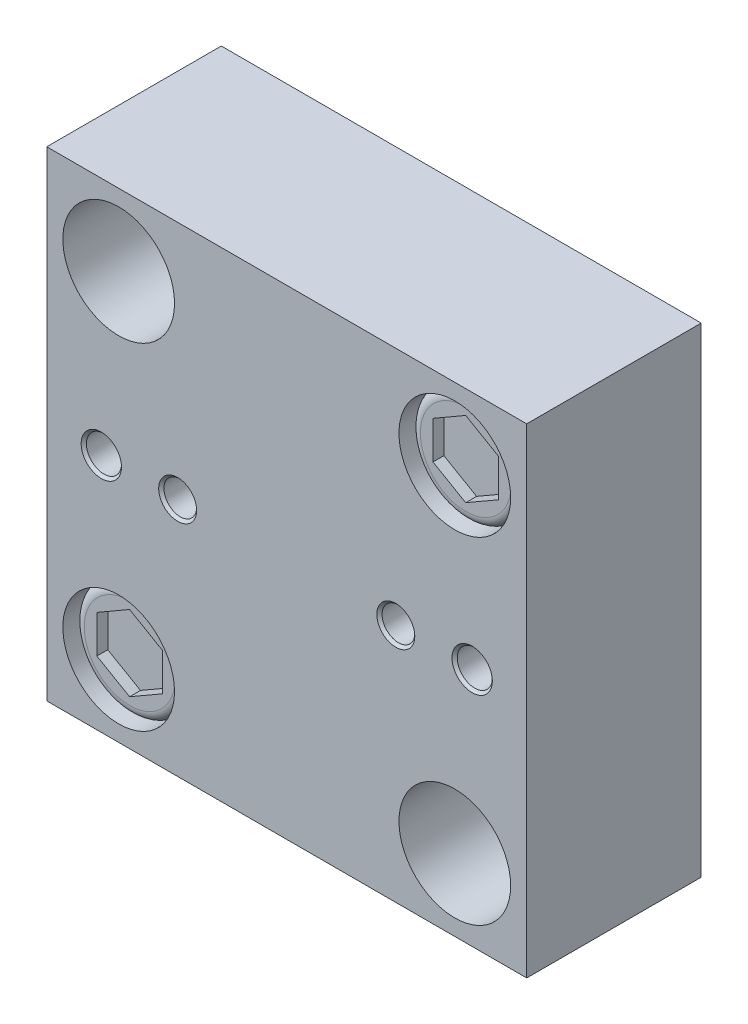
ISO-10303-21;
HEADER;
FILE_DESCRIPTION(('STEP AP214'),'2;1');
FILE_NAME('part.step','',(''),(''),'','','');
FILE_SCHEMA(('AUTOMOTIVE_DESIGN { 1 0 10303 214 1 1 1 1 }'));
ENDSEC;
DATA;
#1=APPLICATION_CONTEXT('core data for automotive mechanical design processes');
#2=APPLICATION_PROTOCOL_DEFINITION('international standard','automotive_design',2000,#1);
#3=PRODUCT_CONTEXT('',#1,'mechanical');
#4=PRODUCT('Part','Part','',(#3));
#5=PRODUCT_RELATED_PRODUCT_CATEGORY('part','',(#4));
#6=PRODUCT_DEFINITION_FORMATION('','',#4);
#7=PRODUCT_DEFINITION_CONTEXT('part definition',#1,'design');
#8=PRODUCT_DEFINITION('design','',#6,#7);
#9=PRODUCT_DEFINITION_SHAPE('','',#8);
#10=(LENGTH_UNIT() NAMED_UNIT(*) SI_UNIT(.MILLI.,.METRE.));
#11=(NAMED_UNIT(*) PLANE_ANGLE_UNIT() SI_UNIT($,.RADIAN.));
#12=(NAMED_UNIT(*) SI_UNIT($,.STERADIAN.) SOLID_ANGLE_UNIT());
#13=UNCERTAINTY_MEASURE_WITH_UNIT(LENGTH_MEASURE(1.E-05),#10,'distance_accuracy_value','');
#14=(GEOMETRIC_REPRESENTATION_CONTEXT(3) GLOBAL_UNCERTAINTY_ASSIGNED_CONTEXT((#13)) GLOBAL_UNIT_ASSIGNED_CONTEXT((#10,
#11,#12)) REPRESENTATION_CONTEXT('',''));
#15=CARTESIAN_POINT('',(0.,0.,0.));
#16=DIRECTION('',(0.,0.,1.));
#17=DIRECTION('',(1.,0.,0.));
#18=AXIS2_PLACEMENT_3D('',#15,#16,#17);
#19=CARTESIAN_POINT('',(-34.925,-34.925,23.8125));
#20=DIRECTION('',(0.,0.,1.));
#21=DIRECTION('',(1.,0.,0.));
#22=AXIS2_PLACEMENT_3D('',#19,#20,#21);
#23=PLANE('',#22);
#24=DIRECTION('',(-0.866025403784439,0.5,0.));
#25=VECTOR('',#24,1.);
#26=CARTESIAN_POINT('',(-19.6977,-21.7105693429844,23.8125));
#27=LINE('',#26,#25);
#28=CARTESIAN_POINT('',(-19.6977,-21.7105693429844,23.8125));
#29=VERTEX_POINT('',#28);
#30=CARTESIAN_POINT('',(-24.4602,-18.9609386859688,23.8125));
#31=VERTEX_POINT('',#30);
#32=EDGE_CURVE('E61',#29,#31,#27,.T.);
#33=ORIENTED_EDGE('',*,*,#32,.F.);
#34=DIRECTION('',(0.,1.,0.));
#35=VECTOR('',#34,1.);
#36=CARTESIAN_POINT('',(-19.6977,-27.2098306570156,23.8125));
#37=LINE('',#36,#35);
#38=CARTESIAN_POINT('',(-19.6977,-27.2098306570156,23.8125));
#39=VERTEX_POINT('',#38);
#40=EDGE_CURVE('E144',#39,#29,#37,.T.);
#41=ORIENTED_EDGE('',*,*,#40,.F.);
#42=DIRECTION('',(0.866025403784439,0.5,0.));
#43=VECTOR('',#42,1.);
#44=CARTESIAN_POINT('',(-24.4602,-29.9594613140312,23.8125));
#45=LINE('',#44,#43);
#46=CARTESIAN_POINT('',(-24.4602,-29.9594613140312,23.8125));
#47=VERTEX_POINT('',#46);
#48=EDGE_CURVE('E142',#47,#39,#45,.T.);
#49=ORIENTED_EDGE('',*,*,#48,.F.);
#50=DIRECTION('',(0.866025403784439,-0.499999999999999,0.));
#51=VECTOR('',#50,1.);
#52=CARTESIAN_POINT('',(-29.2227,-27.2098306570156,23.8125));
#53=LINE('',#52,#51);
#54=CARTESIAN_POINT('',(-29.2227,-27.2098306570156,23.8125));
#55=VERTEX_POINT('',#54);
#56=EDGE_CURVE('E109',#55,#47,#53,.T.);
#57=ORIENTED_EDGE('',*,*,#56,.F.);
#58=DIRECTION('',(0.,-1.,0.));
#59=VECTOR('',#58,1.);
#60=CARTESIAN_POINT('',(-29.2227,-21.7105693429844,23.8125));
#61=LINE('',#60,#59);
#62=CARTESIAN_POINT('',(-29.2227,-21.7105693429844,23.8125));
#63=VERTEX_POINT('',#62);
#64=EDGE_CURVE('E138',#63,#55,#61,.T.);
#65=ORIENTED_EDGE('',*,*,#64,.F.);
#66=DIRECTION('',(-0.866025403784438,-0.5,0.));
#67=VECTOR('',#66,1.);
#68=CARTESIAN_POINT('',(-24.4602,-18.9609386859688,23.8125));
#69=LINE('',#68,#67);
#70=EDGE_CURVE('E135',#31,#63,#69,.T.);
#71=ORIENTED_EDGE('',*,*,#70,.F.);
#72=EDGE_LOOP('',(#33,#41,#49,#57,#65,#71));
#73=FACE_BOUND('',#72,.T.);
#74=CARTESIAN_POINT('',(-24.4602,-24.4602,23.8125));
#75=DIRECTION('',(0.,0.,1.));
#76=DIRECTION('',(1.,0.,0.));
#77=AXIS2_PLACEMENT_3D('',#74,#75,#76);
#78=CIRCLE('',#77,6.60399999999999);
#79=CARTESIAN_POINT('',(-17.8562,-24.4602,23.8125));
#80=VERTEX_POINT('',#79);
#81=EDGE_CURVE('E12',#80,#80,#78,.T.);
#82=ORIENTED_EDGE('',*,*,#81,.T.);
#83=EDGE_LOOP('',(#82));
#84=FACE_BOUND('',#83,.T.);
#85=ADVANCED_FACE('F46',(#73,#84),#23,.T.);
#86=CARTESIAN_POINT('',(-24.4602,-24.4602,0.));
#87=DIRECTION('',(0.,0.,-1.));
#88=DIRECTION('',(-1.,0.,0.));
#89=AXIS2_PLACEMENT_3D('',#86,#87,#88);
#90=PLANE('',#89);
#91=CARTESIAN_POINT('',(-24.4602,-24.4602,0.));
#92=DIRECTION('',(0.,0.,-1.));
#93=DIRECTION('',(-1.,0.,0.));
#94=AXIS2_PLACEMENT_3D('',#91,#92,#93);
#95=CIRCLE('',#94,8.12799999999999);
#96=CARTESIAN_POINT('',(-32.5882,-24.4602,0.));
#97=VERTEX_POINT('',#96);
#98=EDGE_CURVE('E148',#97,#97,#95,.T.);
#99=ORIENTED_EDGE('',*,*,#98,.T.);
#100=EDGE_LOOP('',(#99));
#101=FACE_BOUND('',#100,.T.);
#102=ADVANCED_FACE('F170',(#101),#90,.T.);
#103=CARTESIAN_POINT('',(-24.4602,-24.4602,48.389455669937));
#104=DIRECTION('',(0.,0.,-1.));
#105=DIRECTION('',(-1.,0.,0.));
#106=AXIS2_PLACEMENT_3D('',#103,#104,#105);
#107=CYLINDRICAL_SURFACE('',#106,8.12799999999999);
#108=CARTESIAN_POINT('',(-24.4602,-24.4602,22.2885));
#109=DIRECTION('',(0.,0.,1.));
#110=DIRECTION('',(1.,0.,0.));
#111=AXIS2_PLACEMENT_3D('',#108,#109,#110);
#112=CIRCLE('',#111,8.12799999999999);
#113=CARTESIAN_POINT('',(-16.3322,-24.4602,22.2885));
#114=VERTEX_POINT('',#113);
#115=EDGE_CURVE('E54',#114,#114,#112,.F.);
#116=ORIENTED_EDGE('',*,*,#115,.T.);
#117=EDGE_LOOP('',(#116));
#118=FACE_BOUND('',#117,.T.);
#119=ORIENTED_EDGE('',*,*,#98,.F.);
#120=EDGE_LOOP('',(#119));
#121=FACE_BOUND('',#120,.T.);
#122=ADVANCED_FACE('F158',(#118,#121),#107,.T.);
#123=CARTESIAN_POINT('',(-24.4602,-24.4602,22.2885));
#124=DIRECTION('',(0.,0.,1.));
#125=DIRECTION('',(1.,0.,0.));
#126=AXIS2_PLACEMENT_3D('',#123,#124,#125);
#127=TOROIDAL_SURFACE('',#126,6.60399999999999,1.524);
#128=ORIENTED_EDGE('',*,*,#81,.F.);
#129=EDGE_LOOP('',(#128));
#130=FACE_BOUND('',#129,.T.);
#131=ORIENTED_EDGE('',*,*,#115,.F.);
#132=EDGE_LOOP('',(#131));
#133=FACE_BOUND('',#132,.T.);
#134=ADVANCED_FACE('F48',(#130,#133),#127,.T.);
#135=CARTESIAN_POINT('',(-19.6977,-21.7105693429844,22.225));
#136=DIRECTION('',(0.5,0.866025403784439,0.));
#137=DIRECTION('',(-0.866025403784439,0.5,0.));
#138=AXIS2_PLACEMENT_3D('',#135,#136,#137);
#139=PLANE('',#138);
#140=ORIENTED_EDGE('',*,*,#32,.T.);
#141=DIRECTION('',(0.,0.,1.));
#142=VECTOR('',#141,1.);
#143=CARTESIAN_POINT('',(-24.4602,-18.9609386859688,22.225));
#144=LINE('',#143,#142);
#145=CARTESIAN_POINT('',(-24.4602,-18.9609386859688,22.225));
#146=VERTEX_POINT('',#145);
#147=EDGE_CURVE('E91',#146,#31,#144,.T.);
#148=ORIENTED_EDGE('',*,*,#147,.F.);
#149=DIRECTION('',(-0.866025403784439,0.5,0.));
#150=VECTOR('',#149,1.);
#151=CARTESIAN_POINT('',(-19.6977,-21.7105693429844,22.225));
#152=LINE('',#151,#150);
#153=CARTESIAN_POINT('',(-19.6977,-21.7105693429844,22.225));
#154=VERTEX_POINT('',#153);
#155=EDGE_CURVE('E146',#154,#146,#152,.T.);
#156=ORIENTED_EDGE('',*,*,#155,.F.);
#157=DIRECTION('',(0.,0.,1.));
#158=VECTOR('',#157,1.);
#159=CARTESIAN_POINT('',(-19.6977,-21.7105693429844,22.225));
#160=LINE('',#159,#158);
#161=EDGE_CURVE('E69',#154,#29,#160,.T.);
#162=ORIENTED_EDGE('',*,*,#161,.T.);
#163=EDGE_LOOP('',(#140,#148,#156,#162));
#164=FACE_BOUND('',#163,.T.);
#165=ADVANCED_FACE('F162',(#164),#139,.F.);
#166=CARTESIAN_POINT('',(-19.6977,-27.2098306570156,22.225));
#167=DIRECTION('',(1.,0.,0.));
#168=DIRECTION('',(0.,0.,-1.));
#169=AXIS2_PLACEMENT_3D('',#166,#167,#168);
#170=PLANE('',#169);
#171=ORIENTED_EDGE('',*,*,#40,.T.);
#172=ORIENTED_EDGE('',*,*,#161,.F.);
#173=DIRECTION('',(0.,1.,0.));
#174=VECTOR('',#173,1.);
#175=CARTESIAN_POINT('',(-19.6977,-27.2098306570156,22.225));
#176=LINE('',#175,#174);
#177=CARTESIAN_POINT('',(-19.6977,-27.2098306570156,22.225));
#178=VERTEX_POINT('',#177);
#179=EDGE_CURVE('E121',#178,#154,#176,.T.);
#180=ORIENTED_EDGE('',*,*,#179,.F.);
#181=DIRECTION('',(0.,0.,1.));
#182=VECTOR('',#181,1.);
#183=CARTESIAN_POINT('',(-19.6977,-27.2098306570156,22.225));
#184=LINE('',#183,#182);
#185=EDGE_CURVE('E113',#178,#39,#184,.T.);
#186=ORIENTED_EDGE('',*,*,#185,.T.);
#187=EDGE_LOOP('',(#171,#172,#180,#186));
#188=FACE_BOUND('',#187,.T.);
#189=ADVANCED_FACE('F168',(#188),#170,.F.);
#190=CARTESIAN_POINT('',(-24.4602,-29.9594613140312,22.225));
#191=DIRECTION('',(0.5,-0.866025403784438,0.));
#192=DIRECTION('',(0.866025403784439,0.5,0.));
#193=AXIS2_PLACEMENT_3D('',#190,#191,#192);
#194=PLANE('',#193);
#195=ORIENTED_EDGE('',*,*,#48,.T.);
#196=ORIENTED_EDGE('',*,*,#185,.F.);
#197=DIRECTION('',(0.866025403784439,0.5,0.));
#198=VECTOR('',#197,1.);
#199=CARTESIAN_POINT('',(-24.4602,-29.9594613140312,22.225));
#200=LINE('',#199,#198);
#201=CARTESIAN_POINT('',(-24.4602,-29.9594613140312,22.225));
#202=VERTEX_POINT('',#201);
#203=EDGE_CURVE('E117',#202,#178,#200,.T.);
#204=ORIENTED_EDGE('',*,*,#203,.F.);
#205=DIRECTION('',(0.,0.,1.));
#206=VECTOR('',#205,1.);
#207=CARTESIAN_POINT('',(-24.4602,-29.9594613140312,22.225));
#208=LINE('',#207,#206);
#209=EDGE_CURVE('E102',#202,#47,#208,.T.);
#210=ORIENTED_EDGE('',*,*,#209,.T.);
#211=EDGE_LOOP('',(#195,#196,#204,#210));
#212=FACE_BOUND('',#211,.T.);
#213=ADVANCED_FACE('F118',(#212),#194,.F.);
#214=CARTESIAN_POINT('',(-29.2227,-27.2098306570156,22.225));
#215=DIRECTION('',(-0.499999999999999,-0.866025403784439,0.));
#216=DIRECTION('',(0.866025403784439,-0.5,0.));
#217=AXIS2_PLACEMENT_3D('',#214,#215,#216);
#218=PLANE('',#217);
#219=ORIENTED_EDGE('',*,*,#56,.T.);
#220=ORIENTED_EDGE('',*,*,#209,.F.);
#221=DIRECTION('',(0.866025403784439,-0.499999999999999,0.));
#222=VECTOR('',#221,1.);
#223=CARTESIAN_POINT('',(-29.2227,-27.2098306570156,22.225));
#224=LINE('',#223,#222);
#225=CARTESIAN_POINT('',(-29.2227,-27.2098306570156,22.225));
#226=VERTEX_POINT('',#225);
#227=EDGE_CURVE('E106',#226,#202,#224,.T.);
#228=ORIENTED_EDGE('',*,*,#227,.F.);
#229=DIRECTION('',(0.,0.,1.));
#230=VECTOR('',#229,1.);
#231=CARTESIAN_POINT('',(-29.2227,-27.2098306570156,22.225));
#232=LINE('',#231,#230);
#233=EDGE_CURVE('E114',#226,#55,#232,.T.);
#234=ORIENTED_EDGE('',*,*,#233,.T.);
#235=EDGE_LOOP('',(#219,#220,#228,#234));
#236=FACE_BOUND('',#235,.T.);
#237=ADVANCED_FACE('F104',(#236),#218,.F.);
#238=CARTESIAN_POINT('',(-29.2227,-21.7105693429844,22.225));
#239=DIRECTION('',(-1.,0.,0.));
#240=DIRECTION('',(0.,0.,1.));
#241=AXIS2_PLACEMENT_3D('',#238,#239,#240);
#242=PLANE('',#241);
#243=ORIENTED_EDGE('',*,*,#64,.T.);
#244=ORIENTED_EDGE('',*,*,#233,.F.);
#245=DIRECTION('',(0.,-1.,0.));
#246=VECTOR('',#245,1.);
#247=CARTESIAN_POINT('',(-29.2227,-21.7105693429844,22.225));
#248=LINE('',#247,#246);
#249=CARTESIAN_POINT('',(-29.2227,-21.7105693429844,22.225));
#250=VERTEX_POINT('',#249);
#251=EDGE_CURVE('E127',#250,#226,#248,.T.);
#252=ORIENTED_EDGE('',*,*,#251,.F.);
#253=DIRECTION('',(0.,0.,1.));
#254=VECTOR('',#253,1.);
#255=CARTESIAN_POINT('',(-29.2227,-21.7105693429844,22.225));
#256=LINE('',#255,#254);
#257=EDGE_CURVE('E151',#250,#63,#256,.T.);
#258=ORIENTED_EDGE('',*,*,#257,.T.);
#259=EDGE_LOOP('',(#243,#244,#252,#258));
#260=FACE_BOUND('',#259,.T.);
#261=ADVANCED_FACE('F185',(#260),#242,.F.);
#262=CARTESIAN_POINT('',(-24.4602,-18.9609386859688,22.225));
#263=DIRECTION('',(-0.5,0.866025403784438,0.));
#264=DIRECTION('',(-0.866025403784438,-0.5,0.));
#265=AXIS2_PLACEMENT_3D('',#262,#263,#264);
#266=PLANE('',#265);
#267=ORIENTED_EDGE('',*,*,#70,.T.);
#268=ORIENTED_EDGE('',*,*,#257,.F.);
#269=DIRECTION('',(-0.866025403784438,-0.5,0.));
#270=VECTOR('',#269,1.);
#271=CARTESIAN_POINT('',(-24.4602,-18.9609386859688,22.225));
#272=LINE('',#271,#270);
#273=EDGE_CURVE('E129',#146,#250,#272,.T.);
#274=ORIENTED_EDGE('',*,*,#273,.F.);
#275=ORIENTED_EDGE('',*,*,#147,.T.);
#276=EDGE_LOOP('',(#267,#268,#274,#275));
#277=FACE_BOUND('',#276,.T.);
#278=ADVANCED_FACE('F182',(#277),#266,.F.);
#279=CARTESIAN_POINT('',(0.,0.,22.225));
#280=DIRECTION('',(0.,0.,1.));
#281=DIRECTION('',(1.,0.,0.));
#282=AXIS2_PLACEMENT_3D('',#279,#280,#281);
#283=PLANE('',#282);
#284=ORIENTED_EDGE('',*,*,#155,.T.);
#285=ORIENTED_EDGE('',*,*,#273,.T.);
#286=ORIENTED_EDGE('',*,*,#251,.T.);
#287=ORIENTED_EDGE('',*,*,#227,.T.);
#288=ORIENTED_EDGE('',*,*,#203,.T.);
#289=ORIENTED_EDGE('',*,*,#179,.T.);
#290=EDGE_LOOP('',(#284,#285,#286,#287,#288,#289));
#291=FACE_BOUND('',#290,.T.);
#292=ADVANCED_FACE('F124',(#291),#283,.T.);
#293=CLOSED_SHELL('',(#85,#102,#122,#134,#165,#189,#213,#237,#261,#278,#292));
#294=MANIFOLD_SOLID_BREP('B2',#293);
#295=CARTESIAN_POINT('',(-34.925,-34.925,23.8125));
#296=DIRECTION('',(0.,0.,1.));
#297=DIRECTION('',(1.,0.,0.));
#298=AXIS2_PLACEMENT_3D('',#295,#296,#297);
#299=PLANE('',#298);
#300=DIRECTION('',(-0.866025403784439,0.5,0.));
#301=VECTOR('',#300,1.);
#302=CARTESIAN_POINT('',(29.2227,27.2098306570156,23.8125));
#303=LINE('',#302,#301);
#304=CARTESIAN_POINT('',(29.2227,27.2098306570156,23.8125));
#305=VERTEX_POINT('',#304);
#306=CARTESIAN_POINT('',(24.4602,29.9594613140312,23.8125));
#307=VERTEX_POINT('',#306);
#308=EDGE_CURVE('E292',#305,#307,#303,.T.);
#309=ORIENTED_EDGE('',*,*,#308,.F.);
#310=DIRECTION('',(0.,1.,0.));
#311=VECTOR('',#310,1.);
#312=CARTESIAN_POINT('',(29.2227,21.7105693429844,23.8125));
#313=LINE('',#312,#311);
#314=CARTESIAN_POINT('',(29.2227,21.7105693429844,23.8125));
#315=VERTEX_POINT('',#314);
#316=EDGE_CURVE('E375',#315,#305,#313,.T.);
#317=ORIENTED_EDGE('',*,*,#316,.F.);
#318=DIRECTION('',(0.866025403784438,0.5,0.));
#319=VECTOR('',#318,1.);
#320=CARTESIAN_POINT('',(24.4602,18.9609386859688,23.8125));
#321=LINE('',#320,#319);
#322=CARTESIAN_POINT('',(24.4602,18.9609386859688,23.8125));
#323=VERTEX_POINT('',#322);
#324=EDGE_CURVE('E373',#323,#315,#321,.T.);
#325=ORIENTED_EDGE('',*,*,#324,.F.);
#326=DIRECTION('',(0.866025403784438,-0.5,0.));
#327=VECTOR('',#326,1.);
#328=CARTESIAN_POINT('',(19.6977,21.7105693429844,23.8125));
#329=LINE('',#328,#327);
#330=CARTESIAN_POINT('',(19.6977,21.7105693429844,23.8125));
#331=VERTEX_POINT('',#330);
#332=EDGE_CURVE('E340',#331,#323,#329,.T.);
#333=ORIENTED_EDGE('',*,*,#332,.F.);
#334=DIRECTION('',(0.,-1.,0.));
#335=VECTOR('',#334,1.);
#336=CARTESIAN_POINT('',(19.6977,27.2098306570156,23.8125));
#337=LINE('',#336,#335);
#338=CARTESIAN_POINT('',(19.6977,27.2098306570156,23.8125));
#339=VERTEX_POINT('',#338);
#340=EDGE_CURVE('E369',#339,#331,#337,.T.);
#341=ORIENTED_EDGE('',*,*,#340,.F.);
#342=DIRECTION('',(-0.866025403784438,-0.5,0.));
#343=VECTOR('',#342,1.);
#344=CARTESIAN_POINT('',(24.4602,29.9594613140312,23.8125));
#345=LINE('',#344,#343);
#346=EDGE_CURVE('E366',#307,#339,#345,.T.);
#347=ORIENTED_EDGE('',*,*,#346,.F.);
#348=EDGE_LOOP('',(#309,#317,#325,#333,#341,#347));
#349=FACE_BOUND('',#348,.T.);
#350=CARTESIAN_POINT('',(24.4602,24.4602,23.8125));
#351=DIRECTION('',(0.,0.,1.));
#352=DIRECTION('',(1.,0.,0.));
#353=AXIS2_PLACEMENT_3D('',#350,#351,#352);
#354=CIRCLE('',#353,6.60399999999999);
#355=CARTESIAN_POINT('',(31.0642,24.4602,23.8125));
#356=VERTEX_POINT('',#355);
#357=EDGE_CURVE('E44',#356,#356,#354,.T.);
#358=ORIENTED_EDGE('',*,*,#357,.T.);
#359=EDGE_LOOP('',(#358));
#360=FACE_BOUND('',#359,.T.);
#361=ADVANCED_FACE('F277',(#349,#360),#299,.T.);
#362=CARTESIAN_POINT('',(24.4602,24.4602,0.));
#363=DIRECTION('',(0.,0.,-1.));
#364=DIRECTION('',(-1.,0.,0.));
#365=AXIS2_PLACEMENT_3D('',#362,#363,#364);
#366=PLANE('',#365);
#367=CARTESIAN_POINT('',(24.4602,24.4602,0.));
#368=DIRECTION('',(0.,0.,-1.));
#369=DIRECTION('',(-1.,0.,0.));
#370=AXIS2_PLACEMENT_3D('',#367,#368,#369);
#371=CIRCLE('',#370,8.12799999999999);
#372=CARTESIAN_POINT('',(16.3322,24.4602,0.));
#373=VERTEX_POINT('',#372);
#374=EDGE_CURVE('E379',#373,#373,#371,.T.);
#375=ORIENTED_EDGE('',*,*,#374,.T.);
#376=EDGE_LOOP('',(#375));
#377=FACE_BOUND('',#376,.T.);
#378=ADVANCED_FACE('F401',(#377),#366,.T.);
#379=CARTESIAN_POINT('',(24.4602,24.4602,48.389455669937));
#380=DIRECTION('',(0.,0.,-1.));
#381=DIRECTION('',(-1.,0.,0.));
#382=AXIS2_PLACEMENT_3D('',#379,#380,#381);
#383=CYLINDRICAL_SURFACE('',#382,8.12799999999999);
#384=CARTESIAN_POINT('',(24.4602,24.4602,22.2885));
#385=DIRECTION('',(0.,0.,1.));
#386=DIRECTION('',(1.,0.,0.));
#387=AXIS2_PLACEMENT_3D('',#384,#385,#386);
#388=CIRCLE('',#387,8.12799999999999);
#389=CARTESIAN_POINT('',(32.5882,24.4602,22.2885));
#390=VERTEX_POINT('',#389);
#391=EDGE_CURVE('E285',#390,#390,#388,.F.);
#392=ORIENTED_EDGE('',*,*,#391,.T.);
#393=EDGE_LOOP('',(#392));
#394=FACE_BOUND('',#393,.T.);
#395=ORIENTED_EDGE('',*,*,#374,.F.);
#396=EDGE_LOOP('',(#395));
#397=FACE_BOUND('',#396,.T.);
#398=ADVANCED_FACE('F389',(#394,#397),#383,.T.);
#399=CARTESIAN_POINT('',(24.4602,24.4602,22.2885));
#400=DIRECTION('',(0.,0.,1.));
#401=DIRECTION('',(1.,0.,0.));
#402=AXIS2_PLACEMENT_3D('',#399,#400,#401);
#403=TOROIDAL_SURFACE('',#402,6.60399999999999,1.524);
#404=ORIENTED_EDGE('',*,*,#357,.F.);
#405=EDGE_LOOP('',(#404));
#406=FACE_BOUND('',#405,.T.);
#407=ORIENTED_EDGE('',*,*,#391,.F.);
#408=EDGE_LOOP('',(#407));
#409=FACE_BOUND('',#408,.T.);
#410=ADVANCED_FACE('F279',(#406,#409),#403,.T.);
#411=CARTESIAN_POINT('',(29.2227,27.2098306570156,22.225));
#412=DIRECTION('',(0.5,0.866025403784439,0.));
#413=DIRECTION('',(-0.866025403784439,0.5,0.));
#414=AXIS2_PLACEMENT_3D('',#411,#412,#413);
#415=PLANE('',#414);
#416=ORIENTED_EDGE('',*,*,#308,.T.);
#417=DIRECTION('',(0.,0.,1.));
#418=VECTOR('',#417,1.);
#419=CARTESIAN_POINT('',(24.4602,29.9594613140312,22.225));
#420=LINE('',#419,#418);
#421=CARTESIAN_POINT('',(24.4602,29.9594613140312,22.225));
#422=VERTEX_POINT('',#421);
#423=EDGE_CURVE('E322',#422,#307,#420,.T.);
#424=ORIENTED_EDGE('',*,*,#423,.F.);
#425=DIRECTION('',(-0.866025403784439,0.5,0.));
#426=VECTOR('',#425,1.);
#427=CARTESIAN_POINT('',(29.2227,27.2098306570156,22.225));
#428=LINE('',#427,#426);
#429=CARTESIAN_POINT('',(29.2227,27.2098306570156,22.225));
#430=VERTEX_POINT('',#429);
#431=EDGE_CURVE('E377',#430,#422,#428,.T.);
#432=ORIENTED_EDGE('',*,*,#431,.F.);
#433=DIRECTION('',(0.,0.,1.));
#434=VECTOR('',#433,1.);
#435=CARTESIAN_POINT('',(29.2227,27.2098306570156,22.225));
#436=LINE('',#435,#434);
#437=EDGE_CURVE('E300',#430,#305,#436,.T.);
#438=ORIENTED_EDGE('',*,*,#437,.T.);
#439=EDGE_LOOP('',(#416,#424,#432,#438));
#440=FACE_BOUND('',#439,.T.);
#441=ADVANCED_FACE('F393',(#440),#415,.F.);
#442=CARTESIAN_POINT('',(29.2227,21.7105693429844,22.225));
#443=DIRECTION('',(1.,0.,0.));
#444=DIRECTION('',(0.,0.,-1.));
#445=AXIS2_PLACEMENT_3D('',#442,#443,#444);
#446=PLANE('',#445);
#447=ORIENTED_EDGE('',*,*,#316,.T.);
#448=ORIENTED_EDGE('',*,*,#437,.F.);
#449=DIRECTION('',(0.,1.,0.));
#450=VECTOR('',#449,1.);
#451=CARTESIAN_POINT('',(29.2227,21.7105693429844,22.225));
#452=LINE('',#451,#450);
#453=CARTESIAN_POINT('',(29.2227,21.7105693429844,22.225));
#454=VERTEX_POINT('',#453);
#455=EDGE_CURVE('E352',#454,#430,#452,.T.);
#456=ORIENTED_EDGE('',*,*,#455,.F.);
#457=DIRECTION('',(0.,0.,1.));
#458=VECTOR('',#457,1.);
#459=CARTESIAN_POINT('',(29.2227,21.7105693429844,22.225));
#460=LINE('',#459,#458);
#461=EDGE_CURVE('E344',#454,#315,#460,.T.);
#462=ORIENTED_EDGE('',*,*,#461,.T.);
#463=EDGE_LOOP('',(#447,#448,#456,#462));
#464=FACE_BOUND('',#463,.T.);
#465=ADVANCED_FACE('F399',(#464),#446,.F.);
#466=CARTESIAN_POINT('',(24.4602,18.9609386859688,22.225));
#467=DIRECTION('',(0.5,-0.866025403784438,0.));
#468=DIRECTION('',(0.866025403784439,0.5,0.));
#469=AXIS2_PLACEMENT_3D('',#466,#467,#468);
#470=PLANE('',#469);
#471=ORIENTED_EDGE('',*,*,#324,.T.);
#472=ORIENTED_EDGE('',*,*,#461,.F.);
#473=DIRECTION('',(0.866025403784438,0.5,0.));
#474=VECTOR('',#473,1.);
#475=CARTESIAN_POINT('',(24.4602,18.9609386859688,22.225));
#476=LINE('',#475,#474);
#477=CARTESIAN_POINT('',(24.4602,18.9609386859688,22.225));
#478=VERTEX_POINT('',#477);
#479=EDGE_CURVE('E348',#478,#454,#476,.T.);
#480=ORIENTED_EDGE('',*,*,#479,.F.);
#481=DIRECTION('',(0.,0.,1.));
#482=VECTOR('',#481,1.);
#483=CARTESIAN_POINT('',(24.4602,18.9609386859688,22.225));
#484=LINE('',#483,#482);
#485=EDGE_CURVE('E333',#478,#323,#484,.T.);
#486=ORIENTED_EDGE('',*,*,#485,.T.);
#487=EDGE_LOOP('',(#471,#472,#480,#486));
#488=FACE_BOUND('',#487,.T.);
#489=ADVANCED_FACE('F349',(#488),#470,.F.);
#490=CARTESIAN_POINT('',(19.6977,21.7105693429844,22.225));
#491=DIRECTION('',(-0.5,-0.866025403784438,0.));
#492=DIRECTION('',(0.866025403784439,-0.5,0.));
#493=AXIS2_PLACEMENT_3D('',#490,#491,#492);
#494=PLANE('',#493);
#495=ORIENTED_EDGE('',*,*,#332,.T.);
#496=ORIENTED_EDGE('',*,*,#485,.F.);
#497=DIRECTION('',(0.866025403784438,-0.5,0.));
#498=VECTOR('',#497,1.);
#499=CARTESIAN_POINT('',(19.6977,21.7105693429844,22.225));
#500=LINE('',#499,#498);
#501=CARTESIAN_POINT('',(19.6977,21.7105693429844,22.225));
#502=VERTEX_POINT('',#501);
#503=EDGE_CURVE('E337',#502,#478,#500,.T.);
#504=ORIENTED_EDGE('',*,*,#503,.F.);
#505=DIRECTION('',(0.,0.,1.));
#506=VECTOR('',#505,1.);
#507=CARTESIAN_POINT('',(19.6977,21.7105693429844,22.225));
#508=LINE('',#507,#506);
#509=EDGE_CURVE('E345',#502,#331,#508,.T.);
#510=ORIENTED_EDGE('',*,*,#509,.T.);
#511=EDGE_LOOP('',(#495,#496,#504,#510));
#512=FACE_BOUND('',#511,.T.);
#513=ADVANCED_FACE('F335',(#512),#494,.F.);
#514=CARTESIAN_POINT('',(19.6977,27.2098306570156,22.225));
#515=DIRECTION('',(-1.,0.,0.));
#516=DIRECTION('',(0.,0.,1.));
#517=AXIS2_PLACEMENT_3D('',#514,#515,#516);
#518=PLANE('',#517);
#519=ORIENTED_EDGE('',*,*,#340,.T.);
#520=ORIENTED_EDGE('',*,*,#509,.F.);
#521=DIRECTION('',(0.,-1.,0.));
#522=VECTOR('',#521,1.);
#523=CARTESIAN_POINT('',(19.6977,27.2098306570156,22.225));
#524=LINE('',#523,#522);
#525=CARTESIAN_POINT('',(19.6977,27.2098306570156,22.225));
#526=VERTEX_POINT('',#525);
#527=EDGE_CURVE('E358',#526,#502,#524,.T.);
#528=ORIENTED_EDGE('',*,*,#527,.F.);
#529=DIRECTION('',(0.,0.,1.));
#530=VECTOR('',#529,1.);
#531=CARTESIAN_POINT('',(19.6977,27.2098306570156,22.225));
#532=LINE('',#531,#530);
#533=EDGE_CURVE('E382',#526,#339,#532,.T.);
#534=ORIENTED_EDGE('',*,*,#533,.T.);
#535=EDGE_LOOP('',(#519,#520,#528,#534));
#536=FACE_BOUND('',#535,.T.);
#537=ADVANCED_FACE('F416',(#536),#518,.F.);
#538=CARTESIAN_POINT('',(24.4602,29.9594613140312,22.225));
#539=DIRECTION('',(-0.5,0.866025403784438,0.));
#540=DIRECTION('',(-0.866025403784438,-0.500000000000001,0.));
#541=AXIS2_PLACEMENT_3D('',#538,#539,#540);
#542=PLANE('',#541);
#543=ORIENTED_EDGE('',*,*,#346,.T.);
#544=ORIENTED_EDGE('',*,*,#533,.F.);
#545=DIRECTION('',(-0.866025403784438,-0.5,0.));
#546=VECTOR('',#545,1.);
#547=CARTESIAN_POINT('',(24.4602,29.9594613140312,22.225));
#548=LINE('',#547,#546);
#549=EDGE_CURVE('E360',#422,#526,#548,.T.);
#550=ORIENTED_EDGE('',*,*,#549,.F.);
#551=ORIENTED_EDGE('',*,*,#423,.T.);
#552=EDGE_LOOP('',(#543,#544,#550,#551));
#553=FACE_BOUND('',#552,.T.);
#554=ADVANCED_FACE('F413',(#553),#542,.F.);
#555=CARTESIAN_POINT('',(0.,0.,22.225));
#556=DIRECTION('',(0.,0.,1.));
#557=DIRECTION('',(1.,0.,0.));
#558=AXIS2_PLACEMENT_3D('',#555,#556,#557);
#559=PLANE('',#558);
#560=ORIENTED_EDGE('',*,*,#431,.T.);
#561=ORIENTED_EDGE('',*,*,#549,.T.);
#562=ORIENTED_EDGE('',*,*,#527,.T.);
#563=ORIENTED_EDGE('',*,*,#503,.T.);
#564=ORIENTED_EDGE('',*,*,#479,.T.);
#565=ORIENTED_EDGE('',*,*,#455,.T.);
#566=EDGE_LOOP('',(#560,#561,#562,#563,#564,#565));
#567=FACE_BOUND('',#566,.T.);
#568=ADVANCED_FACE('F355',(#567),#559,.T.);
#569=CLOSED_SHELL('',(#361,#378,#398,#410,#441,#465,#489,#513,#537,#554,#568));
#570=MANIFOLD_SOLID_BREP('B6',#569);
#571=CARTESIAN_POINT('',(-34.925,34.925,25.4));
#572=DIRECTION('',(1.,0.,0.));
#573=DIRECTION('',(0.,1.,0.));
#574=AXIS2_PLACEMENT_3D('',#571,#572,#573);
#575=PLANE('',#574);
#576=DIRECTION('',(0.,-1.,0.));
#577=VECTOR('',#576,1.);
#578=CARTESIAN_POINT('',(-34.925,34.925,0.));
#579=LINE('',#578,#577);
#580=CARTESIAN_POINT('',(-34.925,34.925,0.));
#581=VERTEX_POINT('',#580);
#582=CARTESIAN_POINT('',(-34.925,-34.925,0.));
#583=VERTEX_POINT('',#582);
#584=EDGE_CURVE('E567',#581,#583,#579,.T.);
#585=ORIENTED_EDGE('',*,*,#584,.T.);
#586=DIRECTION('',(0.,0.,-1.));
#587=VECTOR('',#586,1.);
#588=CARTESIAN_POINT('',(-34.925,-34.925,25.4));
#589=LINE('',#588,#587);
#590=CARTESIAN_POINT('',(-34.925,-34.925,25.4));
#591=VERTEX_POINT('',#590);
#592=EDGE_CURVE('E558',#591,#583,#589,.T.);
#593=ORIENTED_EDGE('',*,*,#592,.F.);
#594=DIRECTION('',(0.,-1.,0.));
#595=VECTOR('',#594,1.);
#596=CARTESIAN_POINT('',(-34.925,34.925,25.4));
#597=LINE('',#596,#595);
#598=CARTESIAN_POINT('',(-34.925,34.925,25.4));
#599=VERTEX_POINT('',#598);
#600=EDGE_CURVE('E552',#599,#591,#597,.T.);
#601=ORIENTED_EDGE('',*,*,#600,.F.);
#602=DIRECTION('',(0.,0.,-1.));
#603=VECTOR('',#602,1.);
#604=CARTESIAN_POINT('',(-34.925,34.925,25.4));
#605=LINE('',#604,#603);
#606=EDGE_CURVE('E563',#599,#581,#605,.T.);
#607=ORIENTED_EDGE('',*,*,#606,.T.);
#608=EDGE_LOOP('',(#585,#593,#601,#607));
#609=FACE_BOUND('',#608,.T.);
#610=ADVANCED_FACE('F499',(#609),#575,.F.);
#611=CARTESIAN_POINT('',(-34.925,-34.925,25.4));
#612=DIRECTION('',(0.,1.,0.));
#613=DIRECTION('',(0.,0.,1.));
#614=AXIS2_PLACEMENT_3D('',#611,#612,#613);
#615=PLANE('',#614);
#616=DIRECTION('',(1.,0.,0.));
#617=VECTOR('',#616,1.);
#618=CARTESIAN_POINT('',(-34.925,-34.925,0.));
#619=LINE('',#618,#617);
#620=CARTESIAN_POINT('',(34.925,-34.925,0.));
#621=VERTEX_POINT('',#620);
#622=EDGE_CURVE('E557',#583,#621,#619,.T.);
#623=ORIENTED_EDGE('',*,*,#622,.T.);
#624=DIRECTION('',(0.,0.,-1.));
#625=VECTOR('',#624,1.);
#626=CARTESIAN_POINT('',(34.925,-34.925,25.4));
#627=LINE('',#626,#625);
#628=CARTESIAN_POINT('',(34.925,-34.925,25.4));
#629=VERTEX_POINT('',#628);
#630=EDGE_CURVE('E555',#629,#621,#627,.T.);
#631=ORIENTED_EDGE('',*,*,#630,.F.);
#632=DIRECTION('',(1.,0.,0.));
#633=VECTOR('',#632,1.);
#634=CARTESIAN_POINT('',(-34.925,-34.925,25.4));
#635=LINE('',#634,#633);
#636=EDGE_CURVE('E547',#591,#629,#635,.T.);
#637=ORIENTED_EDGE('',*,*,#636,.F.);
#638=ORIENTED_EDGE('',*,*,#592,.T.);
#639=EDGE_LOOP('',(#623,#631,#637,#638));
#640=FACE_BOUND('',#639,.T.);
#641=ADVANCED_FACE('F556',(#640),#615,.F.);
#642=CARTESIAN_POINT('',(34.925,34.925,25.4));
#643=DIRECTION('',(-1.,0.,0.));
#644=DIRECTION('',(0.,-1.,0.));
#645=AXIS2_PLACEMENT_3D('',#642,#643,#644);
#646=PLANE('',#645);
#647=DIRECTION('',(0.,1.,0.));
#648=VECTOR('',#647,1.);
#649=CARTESIAN_POINT('',(34.925,34.925,0.));
#650=LINE('',#649,#648);
#651=CARTESIAN_POINT('',(34.925,34.925,0.));
#652=VERTEX_POINT('',#651);
#653=EDGE_CURVE('E533',#621,#652,#650,.T.);
#654=ORIENTED_EDGE('',*,*,#653,.T.);
#655=DIRECTION('',(0.,0.,-1.));
#656=VECTOR('',#655,1.);
#657=CARTESIAN_POINT('',(34.925,34.925,25.4));
#658=LINE('',#657,#656);
#659=CARTESIAN_POINT('',(34.925,34.925,25.4));
#660=VERTEX_POINT('',#659);
#661=EDGE_CURVE('E559',#660,#652,#658,.T.);
#662=ORIENTED_EDGE('',*,*,#661,.F.);
#663=DIRECTION('',(0.,1.,0.));
#664=VECTOR('',#663,1.);
#665=CARTESIAN_POINT('',(34.925,34.925,25.4));
#666=LINE('',#665,#664);
#667=EDGE_CURVE('E550',#629,#660,#666,.T.);
#668=ORIENTED_EDGE('',*,*,#667,.F.);
#669=ORIENTED_EDGE('',*,*,#630,.T.);
#670=EDGE_LOOP('',(#654,#662,#668,#669));
#671=FACE_BOUND('',#670,.T.);
#672=ADVANCED_FACE('F561',(#671),#646,.F.);
#673=CARTESIAN_POINT('',(-34.925,34.925,25.4));
#674=DIRECTION('',(0.,-1.,0.));
#675=DIRECTION('',(0.,0.,-1.));
#676=AXIS2_PLACEMENT_3D('',#673,#674,#675);
#677=PLANE('',#676);
#678=DIRECTION('',(-1.,0.,0.));
#679=VECTOR('',#678,1.);
#680=CARTESIAN_POINT('',(-34.925,34.925,0.));
#681=LINE('',#680,#679);
#682=EDGE_CURVE('E539',#652,#581,#681,.T.);
#683=ORIENTED_EDGE('',*,*,#682,.T.);
#684=ORIENTED_EDGE('',*,*,#606,.F.);
#685=DIRECTION('',(-1.,0.,0.));
#686=VECTOR('',#685,1.);
#687=CARTESIAN_POINT('',(-34.925,34.925,25.4));
#688=LINE('',#687,#686);
#689=EDGE_CURVE('E516',#660,#599,#688,.T.);
#690=ORIENTED_EDGE('',*,*,#689,.F.);
#691=ORIENTED_EDGE('',*,*,#661,.T.);
#692=EDGE_LOOP('',(#683,#684,#690,#691));
#693=FACE_BOUND('',#692,.T.);
#694=ADVANCED_FACE('F637',(#693),#677,.F.);
#695=CARTESIAN_POINT('',(-34.925,-34.925,25.4));
#696=DIRECTION('',(0.,0.,1.));
#697=DIRECTION('',(1.,0.,0.));
#698=AXIS2_PLACEMENT_3D('',#695,#696,#697);
#699=PLANE('',#698);
#700=CARTESIAN_POINT('',(-15.875,0.,25.4));
#701=DIRECTION('',(0.,0.,1.));
#702=DIRECTION('',(1.,0.,0.));
#703=AXIS2_PLACEMENT_3D('',#700,#701,#702);
#704=CIRCLE('',#703,2.76224999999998);
#705=CARTESIAN_POINT('',(-13.11275,0.,25.4));
#706=VERTEX_POINT('',#705);
#707=EDGE_CURVE('E586',#706,#706,#704,.F.);
#708=ORIENTED_EDGE('',*,*,#707,.T.);
#709=EDGE_LOOP('',(#708));
#710=FACE_BOUND('',#709,.T.);
#711=CARTESIAN_POINT('',(15.875,0.,25.4));
#712=DIRECTION('',(0.,0.,1.));
#713=DIRECTION('',(1.,0.,0.));
#714=AXIS2_PLACEMENT_3D('',#711,#712,#713);
#715=CIRCLE('',#714,2.76225000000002);
#716=CARTESIAN_POINT('',(18.63725,0.,25.4));
#717=VERTEX_POINT('',#716);
#718=EDGE_CURVE('E583',#717,#717,#715,.F.);
#719=ORIENTED_EDGE('',*,*,#718,.T.);
#720=EDGE_LOOP('',(#719));
#721=FACE_BOUND('',#720,.T.);
#722=CARTESIAN_POINT('',(26.9875,0.,25.4));
#723=DIRECTION('',(0.,0.,1.));
#724=DIRECTION('',(1.,0.,0.));
#725=AXIS2_PLACEMENT_3D('',#722,#723,#724);
#726=CIRCLE('',#725,2.9337);
#727=CARTESIAN_POINT('',(29.9212,0.,25.4));
#728=VERTEX_POINT('',#727);
#729=EDGE_CURVE('E580',#728,#728,#726,.F.);
#730=ORIENTED_EDGE('',*,*,#729,.T.);
#731=EDGE_LOOP('',(#730));
#732=FACE_BOUND('',#731,.T.);
#733=CARTESIAN_POINT('',(-26.9875,0.,25.4));
#734=DIRECTION('',(0.,0.,1.));
#735=DIRECTION('',(1.,0.,0.));
#736=AXIS2_PLACEMENT_3D('',#733,#734,#735);
#737=CIRCLE('',#736,2.9337);
#738=CARTESIAN_POINT('',(-24.0538,0.,25.4));
#739=VERTEX_POINT('',#738);
#740=EDGE_CURVE('E577',#739,#739,#737,.F.);
#741=ORIENTED_EDGE('',*,*,#740,.T.);
#742=EDGE_LOOP('',(#741));
#743=FACE_BOUND('',#742,.T.);
#744=CARTESIAN_POINT('',(24.4602,-24.4602,25.4));
#745=DIRECTION('',(0.,0.,1.));
#746=DIRECTION('',(1.,0.,0.));
#747=AXIS2_PLACEMENT_3D('',#744,#745,#746);
#748=CIRCLE('',#747,8.12799999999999);
#749=CARTESIAN_POINT('',(32.5882,-24.4602,25.4));
#750=VERTEX_POINT('',#749);
#751=EDGE_CURVE('E647',#750,#750,#748,.T.);
#752=ORIENTED_EDGE('',*,*,#751,.F.);
#753=EDGE_LOOP('',(#752));
#754=FACE_BOUND('',#753,.T.);
#755=CARTESIAN_POINT('',(-24.4602,-24.4602,25.4));
#756=DIRECTION('',(0.,0.,1.));
#757=DIRECTION('',(1.,0.,0.));
#758=AXIS2_PLACEMENT_3D('',#755,#756,#757);
#759=CIRCLE('',#758,8.12799999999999);
#760=CARTESIAN_POINT('',(-16.3322,-24.4602,25.4));
#761=VERTEX_POINT('',#760);
#762=EDGE_CURVE('E651',#761,#761,#759,.T.);
#763=ORIENTED_EDGE('',*,*,#762,.F.);
#764=EDGE_LOOP('',(#763));
#765=FACE_BOUND('',#764,.T.);
#766=CARTESIAN_POINT('',(24.4602,24.4602,25.4));
#767=DIRECTION('',(0.,0.,1.));
#768=DIRECTION('',(1.,0.,0.));
#769=AXIS2_PLACEMENT_3D('',#766,#767,#768);
#770=CIRCLE('',#769,8.12799999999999);
#771=CARTESIAN_POINT('',(32.5882,24.4602,25.4));
#772=VERTEX_POINT('',#771);
#773=EDGE_CURVE('E655',#772,#772,#770,.T.);
#774=ORIENTED_EDGE('',*,*,#773,.F.);
#775=EDGE_LOOP('',(#774));
#776=FACE_BOUND('',#775,.T.);
#777=CARTESIAN_POINT('',(-24.4602,24.4602,25.4));
#778=DIRECTION('',(0.,0.,1.));
#779=DIRECTION('',(1.,0.,0.));
#780=AXIS2_PLACEMENT_3D('',#777,#778,#779);
#781=CIRCLE('',#780,8.12799999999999);
#782=CARTESIAN_POINT('',(-16.3322,24.4602,25.4));
#783=VERTEX_POINT('',#782);
#784=EDGE_CURVE('E658',#783,#783,#781,.T.);
#785=ORIENTED_EDGE('',*,*,#784,.F.);
#786=EDGE_LOOP('',(#785));
#787=FACE_BOUND('',#786,.T.);
#788=ORIENTED_EDGE('',*,*,#600,.T.);
#789=ORIENTED_EDGE('',*,*,#636,.T.);
#790=ORIENTED_EDGE('',*,*,#667,.T.);
#791=ORIENTED_EDGE('',*,*,#689,.T.);
#792=EDGE_LOOP('',(#788,#789,#790,#791));
#793=FACE_BOUND('',#792,.T.);
#794=ADVANCED_FACE('F548',(#710,#721,#732,#743,#754,#765,#776,#787,#793),#699,.T.);
#795=CARTESIAN_POINT('',(-34.925,-34.925,0.));
#796=DIRECTION('',(0.,0.,1.));
#797=DIRECTION('',(1.,0.,0.));
#798=AXIS2_PLACEMENT_3D('',#795,#796,#797);
#799=PLANE('',#798);
#800=CARTESIAN_POINT('',(-26.9875,0.,0.));
#801=DIRECTION('',(0.,0.,1.));
#802=DIRECTION('',(1.,0.,0.));
#803=AXIS2_PLACEMENT_3D('',#800,#801,#802);
#804=CIRCLE('',#803,2.55269999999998);
#805=CARTESIAN_POINT('',(-24.4348,0.,0.));
#806=VERTEX_POINT('',#805);
#807=EDGE_CURVE('E697',#806,#806,#804,.T.);
#808=ORIENTED_EDGE('',*,*,#807,.T.);
#809=EDGE_LOOP('',(#808));
#810=FACE_BOUND('',#809,.T.);
#811=CARTESIAN_POINT('',(26.9875,0.,0.));
#812=DIRECTION('',(0.,0.,1.));
#813=DIRECTION('',(1.,0.,0.));
#814=AXIS2_PLACEMENT_3D('',#811,#812,#813);
#815=CIRCLE('',#814,2.55269999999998);
#816=CARTESIAN_POINT('',(29.5402,0.,0.));
#817=VERTEX_POINT('',#816);
#818=EDGE_CURVE('E694',#817,#817,#815,.T.);
#819=ORIENTED_EDGE('',*,*,#818,.T.);
#820=EDGE_LOOP('',(#819));
#821=FACE_BOUND('',#820,.T.);
#822=CARTESIAN_POINT('',(15.875,0.,0.));
#823=DIRECTION('',(0.,0.,-1.));
#824=DIRECTION('',(-1.,0.,0.));
#825=AXIS2_PLACEMENT_3D('',#822,#823,#824);
#826=CIRCLE('',#825,2.98450000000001);
#827=CARTESIAN_POINT('',(12.8905,0.,0.));
#828=VERTEX_POINT('',#827);
#829=EDGE_CURVE('E691',#828,#828,#826,.T.);
#830=ORIENTED_EDGE('',*,*,#829,.F.);
#831=EDGE_LOOP('',(#830));
#832=FACE_BOUND('',#831,.T.);
#833=CARTESIAN_POINT('',(-15.875,0.,0.));
#834=DIRECTION('',(0.,0.,-1.));
#835=DIRECTION('',(-1.,0.,0.));
#836=AXIS2_PLACEMENT_3D('',#833,#834,#835);
#837=CIRCLE('',#836,2.98450000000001);
#838=CARTESIAN_POINT('',(-18.8595,0.,0.));
#839=VERTEX_POINT('',#838);
#840=EDGE_CURVE('E682',#839,#839,#837,.T.);
#841=ORIENTED_EDGE('',*,*,#840,.F.);
#842=EDGE_LOOP('',(#841));
#843=FACE_BOUND('',#842,.T.);
#844=CARTESIAN_POINT('',(24.4602,-24.4602,0.));
#845=DIRECTION('',(0.,0.,1.));
#846=DIRECTION('',(1.,0.,0.));
#847=AXIS2_PLACEMENT_3D('',#844,#845,#846);
#848=CIRCLE('',#847,8.12799999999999);
#849=CARTESIAN_POINT('',(32.5882,-24.4602,0.));
#850=VERTEX_POINT('',#849);
#851=EDGE_CURVE('E670',#850,#850,#848,.T.);
#852=ORIENTED_EDGE('',*,*,#851,.T.);
#853=EDGE_LOOP('',(#852));
#854=FACE_BOUND('',#853,.T.);
#855=CARTESIAN_POINT('',(-24.4602,-24.4602,0.));
#856=DIRECTION('',(0.,0.,1.));
#857=DIRECTION('',(1.,0.,0.));
#858=AXIS2_PLACEMENT_3D('',#855,#856,#857);
#859=CIRCLE('',#858,8.12799999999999);
#860=CARTESIAN_POINT('',(-16.3322,-24.4602,0.));
#861=VERTEX_POINT('',#860);
#862=EDGE_CURVE('E667',#861,#861,#859,.T.);
#863=ORIENTED_EDGE('',*,*,#862,.T.);
#864=EDGE_LOOP('',(#863));
#865=FACE_BOUND('',#864,.T.);
#866=CARTESIAN_POINT('',(24.4602,24.4602,0.));
#867=DIRECTION('',(0.,0.,1.));
#868=DIRECTION('',(1.,0.,0.));
#869=AXIS2_PLACEMENT_3D('',#866,#867,#868);
#870=CIRCLE('',#869,8.12799999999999);
#871=CARTESIAN_POINT('',(32.5882,24.4602,0.));
#872=VERTEX_POINT('',#871);
#873=EDGE_CURVE('E660',#872,#872,#870,.T.);
#874=ORIENTED_EDGE('',*,*,#873,.T.);
#875=EDGE_LOOP('',(#874));
#876=FACE_BOUND('',#875,.T.);
#877=CARTESIAN_POINT('',(-24.4602,24.4602,0.));
#878=DIRECTION('',(0.,0.,1.));
#879=DIRECTION('',(1.,0.,0.));
#880=AXIS2_PLACEMENT_3D('',#877,#878,#879);
#881=CIRCLE('',#880,8.12799999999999);
#882=CARTESIAN_POINT('',(-16.3322,24.4602,0.));
#883=VERTEX_POINT('',#882);
#884=EDGE_CURVE('E570',#883,#883,#881,.T.);
#885=ORIENTED_EDGE('',*,*,#884,.T.);
#886=EDGE_LOOP('',(#885));
#887=FACE_BOUND('',#886,.T.);
#888=ORIENTED_EDGE('',*,*,#584,.F.);
#889=ORIENTED_EDGE('',*,*,#682,.F.);
#890=ORIENTED_EDGE('',*,*,#653,.F.);
#891=ORIENTED_EDGE('',*,*,#622,.F.);
#892=EDGE_LOOP('',(#888,#889,#890,#891));
#893=FACE_BOUND('',#892,.T.);
#894=ADVANCED_FACE('F636',(#810,#821,#832,#843,#854,#865,#876,#887,#893),#799,.F.);
#895=CARTESIAN_POINT('',(-24.4602,24.4602,0.));
#896=DIRECTION('',(0.,0.,1.));
#897=DIRECTION('',(1.,0.,0.));
#898=AXIS2_PLACEMENT_3D('',#895,#896,#897);
#899=CYLINDRICAL_SURFACE('',#898,8.12799999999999);
#900=ORIENTED_EDGE('',*,*,#884,.F.);
#901=EDGE_LOOP('',(#900));
#902=FACE_BOUND('',#901,.T.);
#903=ORIENTED_EDGE('',*,*,#784,.T.);
#904=EDGE_LOOP('',(#903));
#905=FACE_BOUND('',#904,.T.);
#906=ADVANCED_FACE('F704',(#902,#905),#899,.F.);
#907=CARTESIAN_POINT('',(24.4602,24.4602,0.));
#908=DIRECTION('',(0.,0.,1.));
#909=DIRECTION('',(1.,0.,0.));
#910=AXIS2_PLACEMENT_3D('',#907,#908,#909);
#911=CYLINDRICAL_SURFACE('',#910,8.12799999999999);
#912=ORIENTED_EDGE('',*,*,#873,.F.);
#913=EDGE_LOOP('',(#912));
#914=FACE_BOUND('',#913,.T.);
#915=ORIENTED_EDGE('',*,*,#773,.T.);
#916=EDGE_LOOP('',(#915));
#917=FACE_BOUND('',#916,.T.);
#918=ADVANCED_FACE('F729',(#914,#917),#911,.F.);
#919=CARTESIAN_POINT('',(-24.4602,-24.4602,0.));
#920=DIRECTION('',(0.,0.,1.));
#921=DIRECTION('',(1.,0.,0.));
#922=AXIS2_PLACEMENT_3D('',#919,#920,#921);
#923=CYLINDRICAL_SURFACE('',#922,8.12799999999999);
#924=ORIENTED_EDGE('',*,*,#862,.F.);
#925=EDGE_LOOP('',(#924));
#926=FACE_BOUND('',#925,.T.);
#927=ORIENTED_EDGE('',*,*,#762,.T.);
#928=EDGE_LOOP('',(#927));
#929=FACE_BOUND('',#928,.T.);
#930=ADVANCED_FACE('F733',(#926,#929),#923,.F.);
#931=CARTESIAN_POINT('',(24.4602,-24.4602,0.));
#932=DIRECTION('',(0.,0.,1.));
#933=DIRECTION('',(1.,0.,0.));
#934=AXIS2_PLACEMENT_3D('',#931,#932,#933);
#935=CYLINDRICAL_SURFACE('',#934,8.12799999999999);
#936=ORIENTED_EDGE('',*,*,#851,.F.);
#937=EDGE_LOOP('',(#936));
#938=FACE_BOUND('',#937,.T.);
#939=ORIENTED_EDGE('',*,*,#751,.T.);
#940=EDGE_LOOP('',(#939));
#941=FACE_BOUND('',#940,.T.);
#942=ADVANCED_FACE('F737',(#938,#941),#935,.F.);
#943=CARTESIAN_POINT('',(-15.875,0.,0.));
#944=DIRECTION('',(0.,0.,-1.));
#945=DIRECTION('',(-1.,0.,0.));
#946=AXIS2_PLACEMENT_3D('',#943,#944,#945);
#947=CYLINDRICAL_SURFACE('',#946,2.38125000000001);
#948=CARTESIAN_POINT('',(-15.875,0.,25.019));
#949=DIRECTION('',(0.,0.,1.));
#950=DIRECTION('',(1.,0.,0.));
#951=AXIS2_PLACEMENT_3D('',#948,#949,#950);
#952=CIRCLE('',#951,2.38125000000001);
#953=CARTESIAN_POINT('',(-13.49375,0.,25.019));
#954=VERTEX_POINT('',#953);
#955=EDGE_CURVE('E589',#954,#954,#952,.T.);
#956=ORIENTED_EDGE('',*,*,#955,.T.);
#957=EDGE_LOOP('',(#956));
#958=FACE_BOUND('',#957,.T.);
#959=CARTESIAN_POINT('',(-15.875,0.,12.7));
#960=DIRECTION('',(0.,0.,-1.));
#961=DIRECTION('',(-1.,0.,0.));
#962=AXIS2_PLACEMENT_3D('',#959,#960,#961);
#963=CIRCLE('',#962,2.38125000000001);
#964=CARTESIAN_POINT('',(-18.25625,0.,12.7));
#965=VERTEX_POINT('',#964);
#966=EDGE_CURVE('E674',#965,#965,#963,.T.);
#967=ORIENTED_EDGE('',*,*,#966,.T.);
#968=EDGE_LOOP('',(#967));
#969=FACE_BOUND('',#968,.T.);
#970=ADVANCED_FACE('F741',(#958,#969),#947,.F.);
#971=CARTESIAN_POINT('',(-13.49375,0.,12.7));
#972=DIRECTION('',(0.,0.,1.));
#973=DIRECTION('',(1.,0.,0.));
#974=AXIS2_PLACEMENT_3D('',#971,#972,#973);
#975=PLANE('',#974);
#976=ORIENTED_EDGE('',*,*,#966,.F.);
#977=EDGE_LOOP('',(#976));
#978=FACE_BOUND('',#977,.T.);
#979=CARTESIAN_POINT('',(-15.875,0.,12.7));
#980=DIRECTION('',(0.,0.,-1.));
#981=DIRECTION('',(-1.,0.,0.));
#982=AXIS2_PLACEMENT_3D('',#979,#980,#981);
#983=CIRCLE('',#982,2.98450000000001);
#984=CARTESIAN_POINT('',(-18.8595,0.,12.7));
#985=VERTEX_POINT('',#984);
#986=EDGE_CURVE('E679',#985,#985,#983,.T.);
#987=ORIENTED_EDGE('',*,*,#986,.T.);
#988=EDGE_LOOP('',(#987));
#989=FACE_BOUND('',#988,.T.);
#990=ADVANCED_FACE('F745',(#978,#989),#975,.F.);
#991=CARTESIAN_POINT('',(-15.875,0.,0.));
#992=DIRECTION('',(0.,0.,-1.));
#993=DIRECTION('',(-1.,0.,0.));
#994=AXIS2_PLACEMENT_3D('',#991,#992,#993);
#995=CYLINDRICAL_SURFACE('',#994,2.98450000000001);
#996=ORIENTED_EDGE('',*,*,#986,.F.);
#997=EDGE_LOOP('',(#996));
#998=FACE_BOUND('',#997,.T.);
#999=ORIENTED_EDGE('',*,*,#840,.T.);
#1000=EDGE_LOOP('',(#999));
#1001=FACE_BOUND('',#1000,.T.);
#1002=ADVANCED_FACE('F749',(#998,#1001),#995,.F.);
#1003=CARTESIAN_POINT('',(15.875,0.,0.));
#1004=DIRECTION('',(0.,0.,-1.));
#1005=DIRECTION('',(-1.,0.,0.));
#1006=AXIS2_PLACEMENT_3D('',#1003,#1004,#1005);
#1007=CYLINDRICAL_SURFACE('',#1006,2.38125000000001);
#1008=CARTESIAN_POINT('',(15.875,0.,25.019));
#1009=DIRECTION('',(0.,0.,1.));
#1010=DIRECTION('',(1.,0.,0.));
#1011=AXIS2_PLACEMENT_3D('',#1008,#1009,#1010);
#1012=CIRCLE('',#1011,2.38125000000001);
#1013=CARTESIAN_POINT('',(18.25625,0.,25.019));
#1014=VERTEX_POINT('',#1013);
#1015=EDGE_CURVE('E592',#1014,#1014,#1012,.T.);
#1016=ORIENTED_EDGE('',*,*,#1015,.T.);
#1017=EDGE_LOOP('',(#1016));
#1018=FACE_BOUND('',#1017,.T.);
#1019=CARTESIAN_POINT('',(15.875,0.,12.7));
#1020=DIRECTION('',(0.,0.,-1.));
#1021=DIRECTION('',(-1.,0.,0.));
#1022=AXIS2_PLACEMENT_3D('',#1019,#1020,#1021);
#1023=CIRCLE('',#1022,2.38125000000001);
#1024=CARTESIAN_POINT('',(13.49375,0.,12.7));
#1025=VERTEX_POINT('',#1024);
#1026=EDGE_CURVE('E685',#1025,#1025,#1023,.T.);
#1027=ORIENTED_EDGE('',*,*,#1026,.T.);
#1028=EDGE_LOOP('',(#1027));
#1029=FACE_BOUND('',#1028,.T.);
#1030=ADVANCED_FACE('F753',(#1018,#1029),#1007,.F.);
#1031=CARTESIAN_POINT('',(18.25625,0.,12.7));
#1032=DIRECTION('',(0.,0.,1.));
#1033=DIRECTION('',(1.,0.,0.));
#1034=AXIS2_PLACEMENT_3D('',#1031,#1032,#1033);
#1035=PLANE('',#1034);
#1036=ORIENTED_EDGE('',*,*,#1026,.F.);
#1037=EDGE_LOOP('',(#1036));
#1038=FACE_BOUND('',#1037,.T.);
#1039=CARTESIAN_POINT('',(15.875,0.,12.7));
#1040=DIRECTION('',(0.,0.,-1.));
#1041=DIRECTION('',(-1.,0.,0.));
#1042=AXIS2_PLACEMENT_3D('',#1039,#1040,#1041);
#1043=CIRCLE('',#1042,2.98450000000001);
#1044=CARTESIAN_POINT('',(12.8905,0.,12.7));
#1045=VERTEX_POINT('',#1044);
#1046=EDGE_CURVE('E688',#1045,#1045,#1043,.T.);
#1047=ORIENTED_EDGE('',*,*,#1046,.T.);
#1048=EDGE_LOOP('',(#1047));
#1049=FACE_BOUND('',#1048,.T.);
#1050=ADVANCED_FACE('F757',(#1038,#1049),#1035,.F.);
#1051=CARTESIAN_POINT('',(15.875,0.,0.));
#1052=DIRECTION('',(0.,0.,-1.));
#1053=DIRECTION('',(-1.,0.,0.));
#1054=AXIS2_PLACEMENT_3D('',#1051,#1052,#1053);
#1055=CYLINDRICAL_SURFACE('',#1054,2.98450000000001);
#1056=ORIENTED_EDGE('',*,*,#1046,.F.);
#1057=EDGE_LOOP('',(#1056));
#1058=FACE_BOUND('',#1057,.T.);
#1059=ORIENTED_EDGE('',*,*,#829,.T.);
#1060=EDGE_LOOP('',(#1059));
#1061=FACE_BOUND('',#1060,.T.);
#1062=ADVANCED_FACE('F761',(#1058,#1061),#1055,.F.);
#1063=CARTESIAN_POINT('',(26.9875,0.,25.4));
#1064=DIRECTION('',(0.,0.,1.));
#1065=DIRECTION('',(1.,0.,0.));
#1066=AXIS2_PLACEMENT_3D('',#1063,#1064,#1065);
#1067=CYLINDRICAL_SURFACE('',#1066,2.55269999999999);
#1068=CARTESIAN_POINT('',(26.9875,0.,25.019));
#1069=DIRECTION('',(0.,0.,1.));
#1070=DIRECTION('',(1.,0.,0.));
#1071=AXIS2_PLACEMENT_3D('',#1068,#1069,#1070);
#1072=CIRCLE('',#1071,2.55269999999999);
#1073=CARTESIAN_POINT('',(29.5402,0.,25.019));
#1074=VERTEX_POINT('',#1073);
#1075=EDGE_CURVE('E508',#1074,#1074,#1072,.T.);
#1076=ORIENTED_EDGE('',*,*,#1075,.T.);
#1077=EDGE_LOOP('',(#1076));
#1078=FACE_BOUND('',#1077,.T.);
#1079=ORIENTED_EDGE('',*,*,#818,.F.);
#1080=EDGE_LOOP('',(#1079));
#1081=FACE_BOUND('',#1080,.T.);
#1082=ADVANCED_FACE('F597',(#1078,#1081),#1067,.F.);
#1083=CARTESIAN_POINT('',(-26.9875,0.,25.4));
#1084=DIRECTION('',(0.,0.,1.));
#1085=DIRECTION('',(1.,0.,0.));
#1086=AXIS2_PLACEMENT_3D('',#1083,#1084,#1085);
#1087=CYLINDRICAL_SURFACE('',#1086,2.55269999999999);
#1088=CARTESIAN_POINT('',(-26.9875,0.,25.019));
#1089=DIRECTION('',(0.,0.,1.));
#1090=DIRECTION('',(1.,0.,0.));
#1091=AXIS2_PLACEMENT_3D('',#1088,#1089,#1090);
#1092=CIRCLE('',#1091,2.55269999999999);
#1093=CARTESIAN_POINT('',(-24.4348,0.,25.019));
#1094=VERTEX_POINT('',#1093);
#1095=EDGE_CURVE('E275',#1094,#1094,#1092,.T.);
#1096=ORIENTED_EDGE('',*,*,#1095,.T.);
#1097=EDGE_LOOP('',(#1096));
#1098=FACE_BOUND('',#1097,.T.);
#1099=ORIENTED_EDGE('',*,*,#807,.F.);
#1100=EDGE_LOOP('',(#1099));
#1101=FACE_BOUND('',#1100,.T.);
#1102=ADVANCED_FACE('F623',(#1098,#1101),#1087,.F.);
#1103=CARTESIAN_POINT('',(-15.875,0.,25.4));
#1104=DIRECTION('',(0.,0.,1.));
#1105=DIRECTION('',(1.,0.,0.));
#1106=AXIS2_PLACEMENT_3D('',#1103,#1104,#1105);
#1107=CONICAL_SURFACE('',#1106,2.76224999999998,0.785398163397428);
#1108=ORIENTED_EDGE('',*,*,#955,.F.);
#1109=EDGE_LOOP('',(#1108));
#1110=FACE_BOUND('',#1109,.T.);
#1111=ORIENTED_EDGE('',*,*,#707,.F.);
#1112=EDGE_LOOP('',(#1111));
#1113=FACE_BOUND('',#1112,.T.);
#1114=ADVANCED_FACE('F609',(#1110,#1113),#1107,.F.);
#1115=CARTESIAN_POINT('',(15.875,0.,25.4));
#1116=DIRECTION('',(0.,0.,1.));
#1117=DIRECTION('',(1.,0.,0.));
#1118=AXIS2_PLACEMENT_3D('',#1115,#1116,#1117);
#1119=CONICAL_SURFACE('',#1118,2.76225000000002,0.785398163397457);
#1120=ORIENTED_EDGE('',*,*,#1015,.F.);
#1121=EDGE_LOOP('',(#1120));
#1122=FACE_BOUND('',#1121,.T.);
#1123=ORIENTED_EDGE('',*,*,#718,.F.);
#1124=EDGE_LOOP('',(#1123));
#1125=FACE_BOUND('',#1124,.T.);
#1126=ADVANCED_FACE('F602',(#1122,#1125),#1119,.F.);
#1127=CARTESIAN_POINT('',(26.9875,0.,25.019));
#1128=DIRECTION('',(0.,0.,1.));
#1129=DIRECTION('',(1.,0.,0.));
#1130=AXIS2_PLACEMENT_3D('',#1127,#1128,#1129);
#1131=CONICAL_SURFACE('',#1130,2.55269999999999,0.78539816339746);
#1132=ORIENTED_EDGE('',*,*,#729,.F.);
#1133=EDGE_LOOP('',(#1132));
#1134=FACE_BOUND('',#1133,.T.);
#1135=ORIENTED_EDGE('',*,*,#1075,.F.);
#1136=EDGE_LOOP('',(#1135));
#1137=FACE_BOUND('',#1136,.T.);
#1138=ADVANCED_FACE('F600',(#1134,#1137),#1131,.F.);
#1139=CARTESIAN_POINT('',(-26.9875,0.,25.019));
#1140=DIRECTION('',(0.,0.,1.));
#1141=DIRECTION('',(1.,0.,0.));
#1142=AXIS2_PLACEMENT_3D('',#1139,#1140,#1141);
#1143=CONICAL_SURFACE('',#1142,2.55269999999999,0.78539816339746);
#1144=ORIENTED_EDGE('',*,*,#740,.F.);
#1145=EDGE_LOOP('',(#1144));
#1146=FACE_BOUND('',#1145,.T.);
#1147=ORIENTED_EDGE('',*,*,#1095,.F.);
#1148=EDGE_LOOP('',(#1147));
#1149=FACE_BOUND('',#1148,.T.);
#1150=ADVANCED_FACE('F501',(#1146,#1149),#1143,.F.);
#1151=CLOSED_SHELL('',(#610,#641,#672,#694,#794,#894,#906,#918,#930,#942,#970,#990,#1002,#1030,
#1050,#1062,#1082,#1102,#1114,#1126,#1138,#1150));
#1152=MANIFOLD_SOLID_BREP('B38',#1151);
#1153=ADVANCED_BREP_SHAPE_REPRESENTATION('',(#18,#294,#570,#1152),#14);
#1154=SHAPE_DEFINITION_REPRESENTATION(#9,#1153);
ENDSEC;
END-ISO-10303-21;
